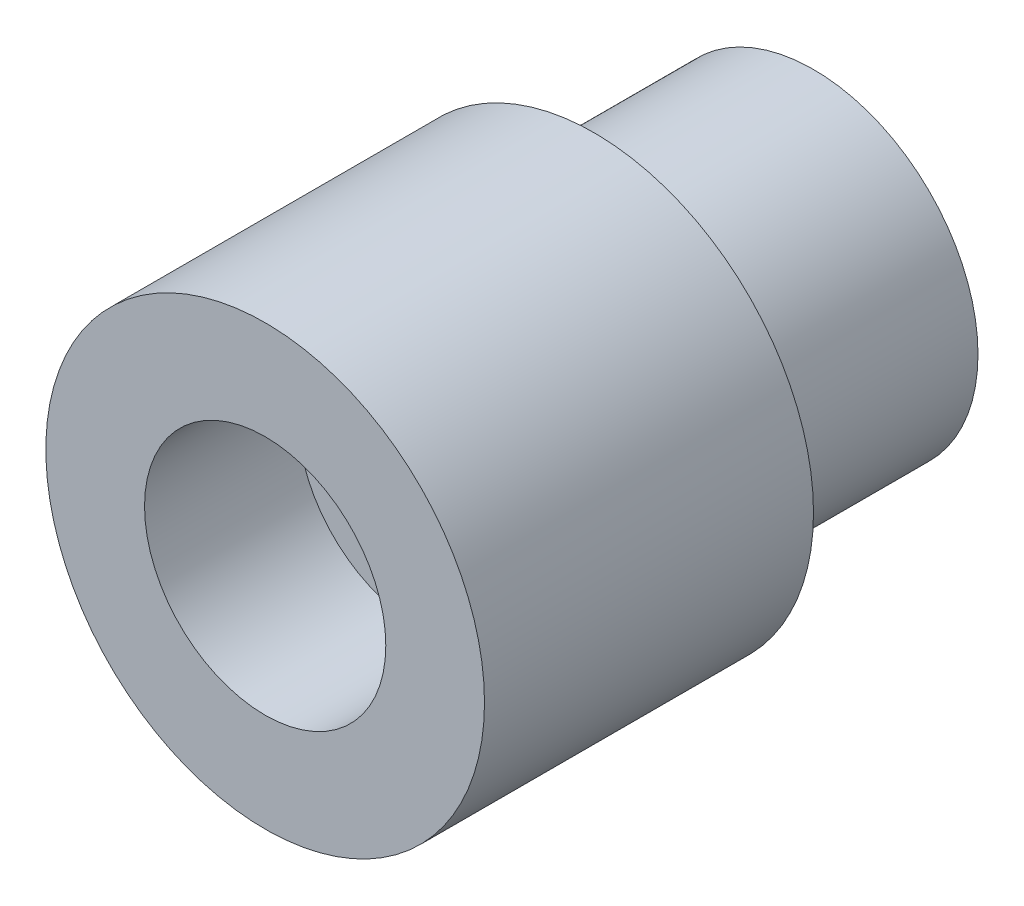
ISO-10303-21;
HEADER;
FILE_DESCRIPTION(('STEP AP214'),'2;1');
FILE_NAME('part.step','',(''),(''),'','','');
FILE_SCHEMA(('AUTOMOTIVE_DESIGN { 1 0 10303 214 1 1 1 1 }'));
ENDSEC;
DATA;
#1=APPLICATION_CONTEXT('core data for automotive mechanical design processes');
#2=APPLICATION_PROTOCOL_DEFINITION('international standard','automotive_design',2000,#1);
#3=PRODUCT_CONTEXT('',#1,'mechanical');
#4=PRODUCT('Part','Part','',(#3));
#5=PRODUCT_RELATED_PRODUCT_CATEGORY('part','',(#4));
#6=PRODUCT_DEFINITION_FORMATION('','',#4);
#7=PRODUCT_DEFINITION_CONTEXT('part definition',#1,'design');
#8=PRODUCT_DEFINITION('design','',#6,#7);
#9=PRODUCT_DEFINITION_SHAPE('','',#8);
#10=(LENGTH_UNIT() NAMED_UNIT(*) SI_UNIT(.MILLI.,.METRE.));
#11=(NAMED_UNIT(*) PLANE_ANGLE_UNIT() SI_UNIT($,.RADIAN.));
#12=(NAMED_UNIT(*) SI_UNIT($,.STERADIAN.) SOLID_ANGLE_UNIT());
#13=UNCERTAINTY_MEASURE_WITH_UNIT(LENGTH_MEASURE(1.E-05),#10,'distance_accuracy_value','');
#14=(GEOMETRIC_REPRESENTATION_CONTEXT(3) GLOBAL_UNCERTAINTY_ASSIGNED_CONTEXT((#13)) GLOBAL_UNIT_ASSIGNED_CONTEXT((#10,
#11,#12)) REPRESENTATION_CONTEXT('',''));
#15=CARTESIAN_POINT('',(0.,0.,0.));
#16=DIRECTION('',(0.,0.,1.));
#17=DIRECTION('',(1.,0.,0.));
#18=AXIS2_PLACEMENT_3D('',#15,#16,#17);
#19=CARTESIAN_POINT('',(10.,0.,15.));
#20=DIRECTION('',(0.,0.,-1.));
#21=DIRECTION('',(-1.,0.,0.));
#22=AXIS2_PLACEMENT_3D('',#19,#20,#21);
#23=PLANE('',#22);
#24=CARTESIAN_POINT('',(0.,0.,15.));
#25=DIRECTION('',(0.,0.,1.));
#26=DIRECTION('',(1.,0.,0.));
#27=AXIS2_PLACEMENT_3D('',#24,#25,#26);
#28=CIRCLE('',#27,5.5);
#29=CARTESIAN_POINT('',(5.5,0.,15.));
#30=VERTEX_POINT('',#29);
#31=EDGE_CURVE('E8',#30,#30,#28,.T.);
#32=ORIENTED_EDGE('',*,*,#31,.F.);
#33=EDGE_LOOP('',(#32));
#34=FACE_BOUND('',#33,.T.);
#35=CARTESIAN_POINT('',(0.,0.,15.));
#36=DIRECTION('',(0.,0.,1.));
#37=DIRECTION('',(1.,0.,0.));
#38=AXIS2_PLACEMENT_3D('',#35,#36,#37);
#39=CIRCLE('',#38,10.);
#40=CARTESIAN_POINT('',(10.,0.,15.));
#41=VERTEX_POINT('',#40);
#42=EDGE_CURVE('E40',#41,#41,#39,.T.);
#43=ORIENTED_EDGE('',*,*,#42,.T.);
#44=EDGE_LOOP('',(#43));
#45=FACE_BOUND('',#44,.T.);
#46=ADVANCED_FACE('F12',(#34,#45),#23,.F.);
#47=CARTESIAN_POINT('',(0.,0.,20.));
#48=DIRECTION('',(0.,0.,1.));
#49=DIRECTION('',(1.,0.,0.));
#50=AXIS2_PLACEMENT_3D('',#47,#48,#49);
#51=CYLINDRICAL_SURFACE('',#50,5.5);
#52=CARTESIAN_POINT('',(0.,0.,8.));
#53=DIRECTION('',(0.,0.,1.));
#54=DIRECTION('',(1.,0.,0.));
#55=AXIS2_PLACEMENT_3D('',#52,#53,#54);
#56=CIRCLE('',#55,5.5);
#57=CARTESIAN_POINT('',(5.5,0.,8.));
#58=VERTEX_POINT('',#57);
#59=EDGE_CURVE('E18',#58,#58,#56,.T.);
#60=ORIENTED_EDGE('',*,*,#59,.F.);
#61=EDGE_LOOP('',(#60));
#62=FACE_BOUND('',#61,.T.);
#63=ORIENTED_EDGE('',*,*,#31,.T.);
#64=EDGE_LOOP('',(#63));
#65=FACE_BOUND('',#64,.T.);
#66=ADVANCED_FACE('F77',(#62,#65),#51,.F.);
#67=CARTESIAN_POINT('',(5.5,0.,8.));
#68=DIRECTION('',(0.,0.,-1.));
#69=DIRECTION('',(-1.,0.,0.));
#70=AXIS2_PLACEMENT_3D('',#67,#68,#69);
#71=PLANE('',#70);
#72=CARTESIAN_POINT('',(0.,0.,8.));
#73=DIRECTION('',(0.,0.,1.));
#74=DIRECTION('',(1.,0.,0.));
#75=AXIS2_PLACEMENT_3D('',#72,#73,#74);
#76=CIRCLE('',#75,3.3);
#77=CARTESIAN_POINT('',(3.3,0.,8.));
#78=VERTEX_POINT('',#77);
#79=EDGE_CURVE('E22',#78,#78,#76,.T.);
#80=ORIENTED_EDGE('',*,*,#79,.F.);
#81=EDGE_LOOP('',(#80));
#82=FACE_BOUND('',#81,.T.);
#83=ORIENTED_EDGE('',*,*,#59,.T.);
#84=EDGE_LOOP('',(#83));
#85=FACE_BOUND('',#84,.T.);
#86=ADVANCED_FACE('F72',(#82,#85),#71,.F.);
#87=CARTESIAN_POINT('',(0.,0.,20.));
#88=DIRECTION('',(0.,0.,1.));
#89=DIRECTION('',(1.,0.,0.));
#90=AXIS2_PLACEMENT_3D('',#87,#88,#89);
#91=CYLINDRICAL_SURFACE('',#90,3.3);
#92=CARTESIAN_POINT('',(0.,0.,-10.));
#93=DIRECTION('',(0.,0.,1.));
#94=DIRECTION('',(1.,0.,0.));
#95=AXIS2_PLACEMENT_3D('',#92,#93,#94);
#96=CIRCLE('',#95,3.3);
#97=CARTESIAN_POINT('',(3.3,0.,-10.));
#98=VERTEX_POINT('',#97);
#99=EDGE_CURVE('E26',#98,#98,#96,.T.);
#100=ORIENTED_EDGE('',*,*,#99,.F.);
#101=EDGE_LOOP('',(#100));
#102=FACE_BOUND('',#101,.T.);
#103=ORIENTED_EDGE('',*,*,#79,.T.);
#104=EDGE_LOOP('',(#103));
#105=FACE_BOUND('',#104,.T.);
#106=ADVANCED_FACE('F66',(#102,#105),#91,.F.);
#107=CARTESIAN_POINT('',(3.3,0.,-10.));
#108=DIRECTION('',(0.,0.,1.));
#109=DIRECTION('',(1.,0.,0.));
#110=AXIS2_PLACEMENT_3D('',#107,#108,#109);
#111=PLANE('',#110);
#112=CARTESIAN_POINT('',(0.,0.,-10.));
#113=DIRECTION('',(0.,0.,1.));
#114=DIRECTION('',(1.,0.,0.));
#115=AXIS2_PLACEMENT_3D('',#112,#113,#114);
#116=CIRCLE('',#115,7.5);
#117=CARTESIAN_POINT('',(7.5,0.,-10.));
#118=VERTEX_POINT('',#117);
#119=EDGE_CURVE('E31',#118,#118,#116,.T.);
#120=ORIENTED_EDGE('',*,*,#119,.F.);
#121=EDGE_LOOP('',(#120));
#122=FACE_BOUND('',#121,.T.);
#123=ORIENTED_EDGE('',*,*,#99,.T.);
#124=EDGE_LOOP('',(#123));
#125=FACE_BOUND('',#124,.T.);
#126=ADVANCED_FACE('F60',(#122,#125),#111,.F.);
#127=CARTESIAN_POINT('',(0.,0.,20.));
#128=DIRECTION('',(0.,0.,1.));
#129=DIRECTION('',(1.,0.,0.));
#130=AXIS2_PLACEMENT_3D('',#127,#128,#129);
#131=CYLINDRICAL_SURFACE('',#130,7.5);
#132=CARTESIAN_POINT('',(0.,0.,0.));
#133=DIRECTION('',(0.,0.,1.));
#134=DIRECTION('',(1.,0.,0.));
#135=AXIS2_PLACEMENT_3D('',#132,#133,#134);
#136=CIRCLE('',#135,7.5);
#137=CARTESIAN_POINT('',(7.5,0.,0.));
#138=VERTEX_POINT('',#137);
#139=EDGE_CURVE('E34',#138,#138,#136,.T.);
#140=ORIENTED_EDGE('',*,*,#139,.F.);
#141=EDGE_LOOP('',(#140));
#142=FACE_BOUND('',#141,.T.);
#143=ORIENTED_EDGE('',*,*,#119,.T.);
#144=EDGE_LOOP('',(#143));
#145=FACE_BOUND('',#144,.T.);
#146=ADVANCED_FACE('F54',(#142,#145),#131,.T.);
#147=CARTESIAN_POINT('',(7.5,0.,0.));
#148=DIRECTION('',(0.,0.,1.));
#149=DIRECTION('',(1.,0.,0.));
#150=AXIS2_PLACEMENT_3D('',#147,#148,#149);
#151=PLANE('',#150);
#152=CARTESIAN_POINT('',(0.,0.,0.));
#153=DIRECTION('',(0.,0.,1.));
#154=DIRECTION('',(1.,0.,0.));
#155=AXIS2_PLACEMENT_3D('',#152,#153,#154);
#156=CIRCLE('',#155,10.);
#157=CARTESIAN_POINT('',(10.,0.,0.));
#158=VERTEX_POINT('',#157);
#159=EDGE_CURVE('E37',#158,#158,#156,.T.);
#160=ORIENTED_EDGE('',*,*,#159,.F.);
#161=EDGE_LOOP('',(#160));
#162=FACE_BOUND('',#161,.T.);
#163=ORIENTED_EDGE('',*,*,#139,.T.);
#164=EDGE_LOOP('',(#163));
#165=FACE_BOUND('',#164,.T.);
#166=ADVANCED_FACE('F48',(#162,#165),#151,.F.);
#167=CARTESIAN_POINT('',(0.,0.,20.));
#168=DIRECTION('',(0.,0.,1.));
#169=DIRECTION('',(1.,0.,0.));
#170=AXIS2_PLACEMENT_3D('',#167,#168,#169);
#171=CYLINDRICAL_SURFACE('',#170,10.);
#172=ORIENTED_EDGE('',*,*,#42,.F.);
#173=EDGE_LOOP('',(#172));
#174=FACE_BOUND('',#173,.T.);
#175=ORIENTED_EDGE('',*,*,#159,.T.);
#176=EDGE_LOOP('',(#175));
#177=FACE_BOUND('',#176,.T.);
#178=ADVANCED_FACE('F45',(#174,#177),#171,.T.);
#179=CLOSED_SHELL('',(#46,#66,#86,#106,#126,#146,#166,#178));
#180=MANIFOLD_SOLID_BREP('B1',#179);
#181=ADVANCED_BREP_SHAPE_REPRESENTATION('',(#18,#180),#14);
#182=SHAPE_DEFINITION_REPRESENTATION(#9,#181);
ENDSEC;
END-ISO-10303-21;
